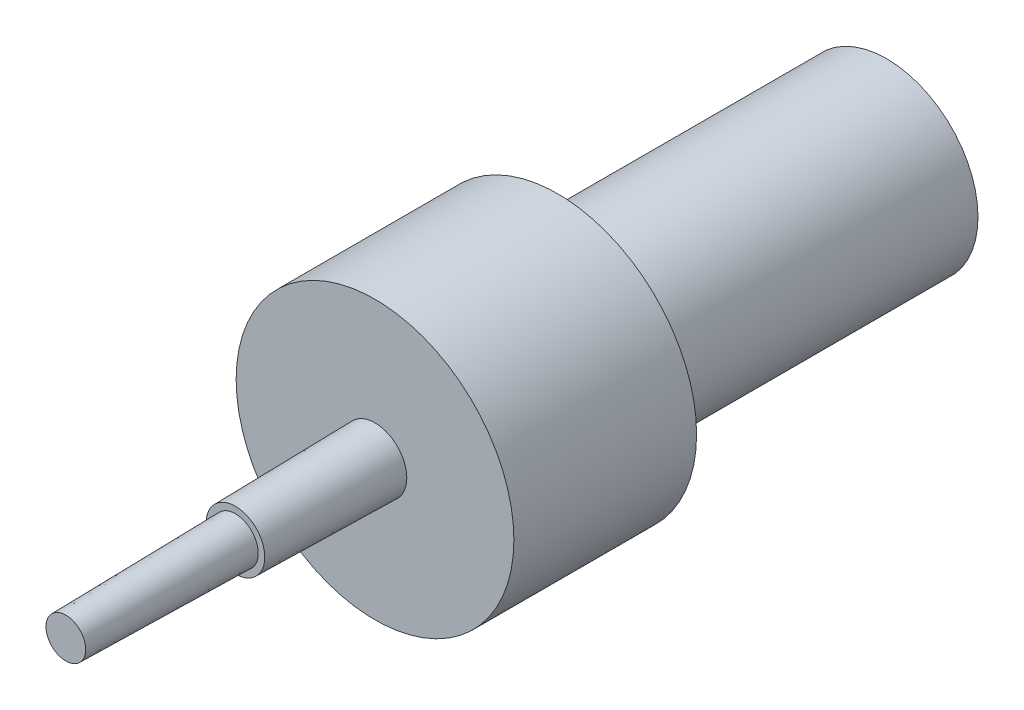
from build123d import *

# Parameters (mm, degrees)
SKETCH1_R      = 3.8
EXTRUDE1_DEPTH = 5
SKETCH2_R      = 0.87
EXTRUDE2_DEPTH = 3.82
EXTRUDE2_TAPER = 1
SKETCH3_R      = 0.625
EXTRUDE3_DEPTH = 4.64
EXTRUDE3_TAPER = 1
SKETCH4_R      = 2.5
EXTRUDE4_DEPTH = 9


with BuildPart() as part:
    # Sketch1 → Extrude1 (new body)
    with BuildSketch(Plane.XY):
        Circle(SKETCH1_R)
    extrude(amount=EXTRUDE1_DEPTH)

    # Sketch2 → Extrude2 (add)
    with BuildSketch(Plane.XY.offset(5)):
        Circle(SKETCH2_R)
    extrude(amount=EXTRUDE2_DEPTH, taper=EXTRUDE2_TAPER)

    # Sketch3 → Extrude3 (add)
    with BuildSketch(Plane.XY.offset(8.82)):
        Circle(SKETCH3_R)
    extrude(amount=EXTRUDE3_DEPTH, taper=EXTRUDE3_TAPER)

    # Sketch4 → Extrude4 (add)
    with BuildSketch(Plane(origin=(0, 0, 0), x_dir=(-1, 0, 0), z_dir=(0, 0, -1))):
        with Locations(Location((0, 0, 0), (0, 0, 180))):
            Circle(SKETCH4_R)
    extrude(amount=EXTRUDE4_DEPTH)


solid = part.part
